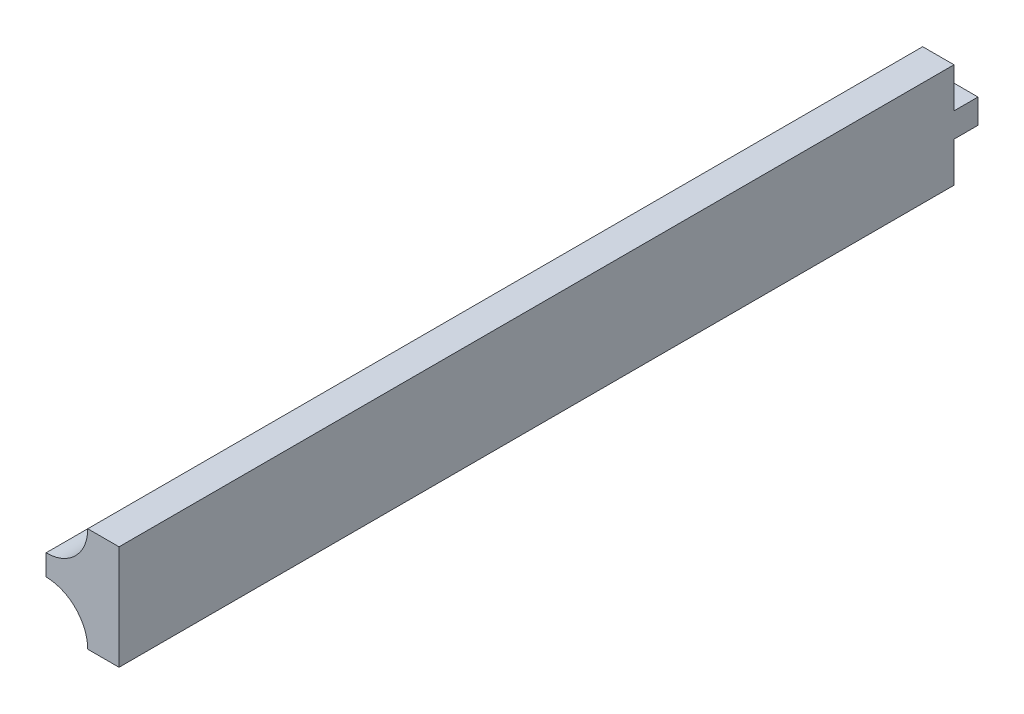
ISO-10303-21;
HEADER;
FILE_DESCRIPTION(('STEP AP214'),'2;1');
FILE_NAME('part.step','',(''),(''),'','','');
FILE_SCHEMA(('AUTOMOTIVE_DESIGN { 1 0 10303 214 1 1 1 1 }'));
ENDSEC;
DATA;
#1=APPLICATION_CONTEXT('core data for automotive mechanical design processes');
#2=APPLICATION_PROTOCOL_DEFINITION('international standard','automotive_design',2000,#1);
#3=PRODUCT_CONTEXT('',#1,'mechanical');
#4=PRODUCT('Part','Part','',(#3));
#5=PRODUCT_RELATED_PRODUCT_CATEGORY('part','',(#4));
#6=PRODUCT_DEFINITION_FORMATION('','',#4);
#7=PRODUCT_DEFINITION_CONTEXT('part definition',#1,'design');
#8=PRODUCT_DEFINITION('design','',#6,#7);
#9=PRODUCT_DEFINITION_SHAPE('','',#8);
#10=(LENGTH_UNIT() NAMED_UNIT(*) SI_UNIT(.MILLI.,.METRE.));
#11=(NAMED_UNIT(*) PLANE_ANGLE_UNIT() SI_UNIT($,.RADIAN.));
#12=(NAMED_UNIT(*) SI_UNIT($,.STERADIAN.) SOLID_ANGLE_UNIT());
#13=UNCERTAINTY_MEASURE_WITH_UNIT(LENGTH_MEASURE(1.E-05),#10,'distance_accuracy_value','');
#14=(GEOMETRIC_REPRESENTATION_CONTEXT(3) GLOBAL_UNCERTAINTY_ASSIGNED_CONTEXT((#13)) GLOBAL_UNIT_ASSIGNED_CONTEXT((#10,
#11,#12)) REPRESENTATION_CONTEXT('',''));
#15=CARTESIAN_POINT('',(0.,0.,0.));
#16=DIRECTION('',(0.,0.,1.));
#17=DIRECTION('',(1.,0.,0.));
#18=AXIS2_PLACEMENT_3D('',#15,#16,#17);
#19=CARTESIAN_POINT('',(0.,0.,0.));
#20=DIRECTION('',(0.,0.,-1.));
#21=DIRECTION('',(-1.,0.,0.));
#22=AXIS2_PLACEMENT_3D('',#19,#20,#21);
#23=PLANE('',#22);
#24=DIRECTION('',(0.,-1.,0.));
#25=VECTOR('',#24,1.);
#26=CARTESIAN_POINT('',(109.22,0.,0.));
#27=LINE('',#26,#25);
#28=CARTESIAN_POINT('',(109.22,2.54000000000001,0.));
#29=VERTEX_POINT('',#28);
#30=CARTESIAN_POINT('',(109.22,-2.53999999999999,0.));
#31=VERTEX_POINT('',#30);
#32=EDGE_CURVE('E177',#29,#31,#27,.T.);
#33=ORIENTED_EDGE('',*,*,#32,.F.);
#34=CARTESIAN_POINT('',(109.22,12.7,0.));
#35=DIRECTION('',(0.,0.,1.));
#36=DIRECTION('',(1.,0.,0.));
#37=AXIS2_PLACEMENT_3D('',#34,#35,#36);
#38=CIRCLE('',#37,10.16);
#39=CARTESIAN_POINT('',(119.38,12.7,0.));
#40=VERTEX_POINT('',#39);
#41=EDGE_CURVE('E203',#40,#29,#38,.F.);
#42=ORIENTED_EDGE('',*,*,#41,.F.);
#43=DIRECTION('',(-1.,0.,0.));
#44=VECTOR('',#43,1.);
#45=CARTESIAN_POINT('',(127.,12.7,0.));
#46=LINE('',#45,#44);
#47=CARTESIAN_POINT('',(127.,12.7,0.));
#48=VERTEX_POINT('',#47);
#49=EDGE_CURVE('E206',#48,#40,#46,.T.);
#50=ORIENTED_EDGE('',*,*,#49,.F.);
#51=DIRECTION('',(0.,1.,0.));
#52=VECTOR('',#51,1.);
#53=CARTESIAN_POINT('',(127.,2.54000000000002,0.));
#54=LINE('',#53,#52);
#55=CARTESIAN_POINT('',(127.,2.9845,0.));
#56=VERTEX_POINT('',#55);
#57=EDGE_CURVE('E209',#56,#48,#54,.T.);
#58=ORIENTED_EDGE('',*,*,#57,.F.);
#59=DIRECTION('',(1.,0.,0.));
#60=VECTOR('',#59,1.);
#61=CARTESIAN_POINT('',(127.,2.9845,0.));
#62=LINE('',#61,#60);
#63=CARTESIAN_POINT('',(121.031,2.9845,0.));
#64=VERTEX_POINT('',#63);
#65=EDGE_CURVE('E193',#64,#56,#62,.T.);
#66=ORIENTED_EDGE('',*,*,#65,.F.);
#67=DIRECTION('',(0.,1.,0.));
#68=VECTOR('',#67,1.);
#69=CARTESIAN_POINT('',(121.031,2.9845,0.));
#70=LINE('',#69,#68);
#71=CARTESIAN_POINT('',(121.031,-2.9845,0.));
#72=VERTEX_POINT('',#71);
#73=EDGE_CURVE('E179',#72,#64,#70,.T.);
#74=ORIENTED_EDGE('',*,*,#73,.F.);
#75=DIRECTION('',(-1.,0.,0.));
#76=VECTOR('',#75,1.);
#77=CARTESIAN_POINT('',(127.,-2.9845,0.));
#78=LINE('',#77,#76);
#79=CARTESIAN_POINT('',(127.,-2.9845,0.));
#80=VERTEX_POINT('',#79);
#81=EDGE_CURVE('E184',#80,#72,#78,.T.);
#82=ORIENTED_EDGE('',*,*,#81,.F.);
#83=CARTESIAN_POINT('',(127.,-12.7,0.));
#84=VERTEX_POINT('',#83);
#85=EDGE_CURVE('E210',#84,#80,#54,.T.);
#86=ORIENTED_EDGE('',*,*,#85,.F.);
#87=DIRECTION('',(-1.,0.,0.));
#88=VECTOR('',#87,1.);
#89=CARTESIAN_POINT('',(127.,-12.7,0.));
#90=LINE('',#89,#88);
#91=CARTESIAN_POINT('',(119.38,-12.7,0.));
#92=VERTEX_POINT('',#91);
#93=EDGE_CURVE('E213',#84,#92,#90,.T.);
#94=ORIENTED_EDGE('',*,*,#93,.T.);
#95=CARTESIAN_POINT('',(109.22,-12.7,0.));
#96=DIRECTION('',(0.,0.,1.));
#97=DIRECTION('',(1.,0.,0.));
#98=AXIS2_PLACEMENT_3D('',#95,#96,#97);
#99=CIRCLE('',#98,10.16);
#100=EDGE_CURVE('E215',#31,#92,#99,.F.);
#101=ORIENTED_EDGE('',*,*,#100,.F.);
#102=EDGE_LOOP('',(#33,#42,#50,#58,#66,#74,#82,#86,#94,#101));
#103=FACE_BOUND('',#102,.T.);
#104=ADVANCED_FACE('F35',(#103),#23,.T.);
#105=CARTESIAN_POINT('',(127.,2.54000000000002,203.2));
#106=DIRECTION('',(-1.,0.,0.));
#107=DIRECTION('',(0.,0.,1.));
#108=AXIS2_PLACEMENT_3D('',#105,#106,#107);
#109=PLANE('',#108);
#110=DIRECTION('',(0.,0.,-1.));
#111=VECTOR('',#110,1.);
#112=CARTESIAN_POINT('',(127.,-12.7,215.9));
#113=LINE('',#112,#111);
#114=CARTESIAN_POINT('',(127.,-12.7,203.2));
#115=VERTEX_POINT('',#114);
#116=EDGE_CURVE('E218',#115,#84,#113,.T.);
#117=ORIENTED_EDGE('',*,*,#116,.T.);
#118=ORIENTED_EDGE('',*,*,#85,.T.);
#119=DIRECTION('',(0.,0.,1.));
#120=VECTOR('',#119,1.);
#121=CARTESIAN_POINT('',(127.,-2.9845,-5.842));
#122=LINE('',#121,#120);
#123=CARTESIAN_POINT('',(127.,-2.9845,-5.842));
#124=VERTEX_POINT('',#123);
#125=EDGE_CURVE('E198',#124,#80,#122,.T.);
#126=ORIENTED_EDGE('',*,*,#125,.F.);
#127=DIRECTION('',(0.,-1.,0.));
#128=VECTOR('',#127,1.);
#129=CARTESIAN_POINT('',(127.,2.9845,-5.842));
#130=LINE('',#129,#128);
#131=CARTESIAN_POINT('',(127.,2.9845,-5.842));
#132=VERTEX_POINT('',#131);
#133=EDGE_CURVE('E186',#132,#124,#130,.T.);
#134=ORIENTED_EDGE('',*,*,#133,.F.);
#135=DIRECTION('',(0.,0.,1.));
#136=VECTOR('',#135,1.);
#137=CARTESIAN_POINT('',(127.,2.9845,-5.842));
#138=LINE('',#137,#136);
#139=EDGE_CURVE('E58',#132,#56,#138,.T.);
#140=ORIENTED_EDGE('',*,*,#139,.T.);
#141=ORIENTED_EDGE('',*,*,#57,.T.);
#142=DIRECTION('',(0.,0.,-1.));
#143=VECTOR('',#142,1.);
#144=CARTESIAN_POINT('',(127.,12.7,215.9));
#145=LINE('',#144,#143);
#146=CARTESIAN_POINT('',(127.,12.7,203.2));
#147=VERTEX_POINT('',#146);
#148=EDGE_CURVE('E232',#147,#48,#145,.T.);
#149=ORIENTED_EDGE('',*,*,#148,.F.);
#150=DIRECTION('',(0.,1.,0.));
#151=VECTOR('',#150,1.);
#152=CARTESIAN_POINT('',(127.,2.54000000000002,203.2));
#153=LINE('',#152,#151);
#154=EDGE_CURVE('E231',#115,#147,#153,.T.);
#155=ORIENTED_EDGE('',*,*,#154,.F.);
#156=EDGE_LOOP('',(#117,#118,#126,#134,#140,#141,#149,#155));
#157=FACE_BOUND('',#156,.T.);
#158=ADVANCED_FACE('F264',(#157),#109,.F.);
#159=CARTESIAN_POINT('',(0.,0.,203.2));
#160=DIRECTION('',(0.,0.,-1.));
#161=DIRECTION('',(-1.,0.,0.));
#162=AXIS2_PLACEMENT_3D('',#159,#160,#161);
#163=PLANE('',#162);
#164=CARTESIAN_POINT('',(109.22,12.7,203.2));
#165=DIRECTION('',(0.,0.,-1.));
#166=DIRECTION('',(-1.,0.,0.));
#167=AXIS2_PLACEMENT_3D('',#164,#165,#166);
#168=CIRCLE('',#167,10.16);
#169=CARTESIAN_POINT('',(119.38,12.7,203.2));
#170=VERTEX_POINT('',#169);
#171=CARTESIAN_POINT('',(109.22,2.54000000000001,203.2));
#172=VERTEX_POINT('',#171);
#173=EDGE_CURVE('E43',#170,#172,#168,.T.);
#174=ORIENTED_EDGE('',*,*,#173,.T.);
#175=DIRECTION('',(0.,-1.,0.));
#176=VECTOR('',#175,1.);
#177=CARTESIAN_POINT('',(109.22,0.,203.2));
#178=LINE('',#177,#176);
#179=CARTESIAN_POINT('',(109.22,-2.53999999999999,203.2));
#180=VERTEX_POINT('',#179);
#181=EDGE_CURVE('E171',#172,#180,#178,.T.);
#182=ORIENTED_EDGE('',*,*,#181,.T.);
#183=CARTESIAN_POINT('',(109.22,-12.7,203.2));
#184=DIRECTION('',(0.,0.,-1.));
#185=DIRECTION('',(-1.,0.,0.));
#186=AXIS2_PLACEMENT_3D('',#183,#184,#185);
#187=CIRCLE('',#186,10.16);
#188=CARTESIAN_POINT('',(119.38,-12.7,203.2));
#189=VERTEX_POINT('',#188);
#190=EDGE_CURVE('E11',#180,#189,#187,.T.);
#191=ORIENTED_EDGE('',*,*,#190,.T.);
#192=DIRECTION('',(1.,0.,0.));
#193=VECTOR('',#192,1.);
#194=CARTESIAN_POINT('',(127.,-12.7,203.2));
#195=LINE('',#194,#193);
#196=EDGE_CURVE('E224',#189,#115,#195,.T.);
#197=ORIENTED_EDGE('',*,*,#196,.T.);
#198=ORIENTED_EDGE('',*,*,#154,.T.);
#199=DIRECTION('',(1.,0.,0.));
#200=VECTOR('',#199,1.);
#201=CARTESIAN_POINT('',(127.,12.7,203.2));
#202=LINE('',#201,#200);
#203=EDGE_CURVE('E228',#170,#147,#202,.T.);
#204=ORIENTED_EDGE('',*,*,#203,.F.);
#205=EDGE_LOOP('',(#174,#182,#191,#197,#198,#204));
#206=FACE_BOUND('',#205,.T.);
#207=ADVANCED_FACE('F245',(#206),#163,.F.);
#208=CARTESIAN_POINT('',(127.,12.7,215.9));
#209=DIRECTION('',(0.,-1.,0.));
#210=DIRECTION('',(0.,0.,-1.));
#211=AXIS2_PLACEMENT_3D('',#208,#209,#210);
#212=PLANE('',#211);
#213=ORIENTED_EDGE('',*,*,#148,.T.);
#214=ORIENTED_EDGE('',*,*,#49,.T.);
#215=DIRECTION('',(0.,0.,-1.));
#216=VECTOR('',#215,1.);
#217=CARTESIAN_POINT('',(119.38,12.7,215.9));
#218=LINE('',#217,#216);
#219=EDGE_CURVE('E227',#170,#40,#218,.T.);
#220=ORIENTED_EDGE('',*,*,#219,.F.);
#221=ORIENTED_EDGE('',*,*,#203,.T.);
#222=EDGE_LOOP('',(#213,#214,#220,#221));
#223=FACE_BOUND('',#222,.T.);
#224=ADVANCED_FACE('F269',(#223),#212,.F.);
#225=CARTESIAN_POINT('',(127.,-12.7,215.9));
#226=DIRECTION('',(0.,-1.,0.));
#227=DIRECTION('',(1.,0.,0.));
#228=AXIS2_PLACEMENT_3D('',#225,#226,#227);
#229=PLANE('',#228);
#230=ORIENTED_EDGE('',*,*,#93,.F.);
#231=ORIENTED_EDGE('',*,*,#116,.F.);
#232=ORIENTED_EDGE('',*,*,#196,.F.);
#233=DIRECTION('',(0.,0.,-1.));
#234=VECTOR('',#233,1.);
#235=CARTESIAN_POINT('',(119.38,-12.7,215.9));
#236=LINE('',#235,#234);
#237=EDGE_CURVE('E221',#189,#92,#236,.T.);
#238=ORIENTED_EDGE('',*,*,#237,.T.);
#239=EDGE_LOOP('',(#230,#231,#232,#238));
#240=FACE_BOUND('',#239,.T.);
#241=ADVANCED_FACE('F263',(#240),#229,.T.);
#242=CARTESIAN_POINT('',(109.22,12.7,203.2));
#243=DIRECTION('',(0.,0.,1.));
#244=DIRECTION('',(1.,0.,0.));
#245=AXIS2_PLACEMENT_3D('',#242,#243,#244);
#246=CYLINDRICAL_SURFACE('',#245,10.16);
#247=ORIENTED_EDGE('',*,*,#219,.T.);
#248=ORIENTED_EDGE('',*,*,#41,.T.);
#249=DIRECTION('',(0.,0.,-1.));
#250=VECTOR('',#249,1.);
#251=CARTESIAN_POINT('',(109.22,2.54000000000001,-12.7));
#252=LINE('',#251,#250);
#253=EDGE_CURVE('E238',#172,#29,#252,.T.);
#254=ORIENTED_EDGE('',*,*,#253,.F.);
#255=ORIENTED_EDGE('',*,*,#173,.F.);
#256=EDGE_LOOP('',(#247,#248,#254,#255));
#257=FACE_BOUND('',#256,.T.);
#258=ADVANCED_FACE('F249',(#257),#246,.F.);
#259=CARTESIAN_POINT('',(109.22,-12.7,215.9));
#260=DIRECTION('',(0.,0.,-1.));
#261=DIRECTION('',(-1.,0.,0.));
#262=AXIS2_PLACEMENT_3D('',#259,#260,#261);
#263=CYLINDRICAL_SURFACE('',#262,10.16);
#264=DIRECTION('',(0.,0.,-1.));
#265=VECTOR('',#264,1.);
#266=CARTESIAN_POINT('',(109.22,-2.53999999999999,203.2));
#267=LINE('',#266,#265);
#268=EDGE_CURVE('E240',#31,#180,#267,.F.);
#269=ORIENTED_EDGE('',*,*,#268,.F.);
#270=ORIENTED_EDGE('',*,*,#100,.T.);
#271=ORIENTED_EDGE('',*,*,#237,.F.);
#272=ORIENTED_EDGE('',*,*,#190,.F.);
#273=EDGE_LOOP('',(#269,#270,#271,#272));
#274=FACE_BOUND('',#273,.T.);
#275=ADVANCED_FACE('F37',(#274),#263,.F.);
#276=CARTESIAN_POINT('',(121.031,2.9845,-5.842));
#277=DIRECTION('',(1.,0.,0.));
#278=DIRECTION('',(0.,0.,-1.));
#279=AXIS2_PLACEMENT_3D('',#276,#277,#278);
#280=PLANE('',#279);
#281=ORIENTED_EDGE('',*,*,#73,.T.);
#282=DIRECTION('',(0.,0.,1.));
#283=VECTOR('',#282,1.);
#284=CARTESIAN_POINT('',(121.031,2.9845,-5.842));
#285=LINE('',#284,#283);
#286=CARTESIAN_POINT('',(121.031,2.9845,-5.842));
#287=VERTEX_POINT('',#286);
#288=EDGE_CURVE('E201',#287,#64,#285,.T.);
#289=ORIENTED_EDGE('',*,*,#288,.F.);
#290=DIRECTION('',(0.,1.,0.));
#291=VECTOR('',#290,1.);
#292=CARTESIAN_POINT('',(121.031,2.9845,-5.842));
#293=LINE('',#292,#291);
#294=CARTESIAN_POINT('',(121.031,-2.9845,-5.842));
#295=VERTEX_POINT('',#294);
#296=EDGE_CURVE('E180',#295,#287,#293,.T.);
#297=ORIENTED_EDGE('',*,*,#296,.F.);
#298=DIRECTION('',(0.,0.,1.));
#299=VECTOR('',#298,1.);
#300=CARTESIAN_POINT('',(121.031,-2.9845,-5.842));
#301=LINE('',#300,#299);
#302=EDGE_CURVE('E190',#295,#72,#301,.T.);
#303=ORIENTED_EDGE('',*,*,#302,.T.);
#304=EDGE_LOOP('',(#281,#289,#297,#303));
#305=FACE_BOUND('',#304,.T.);
#306=ADVANCED_FACE('F278',(#305),#280,.F.);
#307=CARTESIAN_POINT('',(127.,2.9845,-5.842));
#308=DIRECTION('',(0.,-1.,0.));
#309=DIRECTION('',(0.,0.,-1.));
#310=AXIS2_PLACEMENT_3D('',#307,#308,#309);
#311=PLANE('',#310);
#312=ORIENTED_EDGE('',*,*,#65,.T.);
#313=ORIENTED_EDGE('',*,*,#139,.F.);
#314=DIRECTION('',(1.,0.,0.));
#315=VECTOR('',#314,1.);
#316=CARTESIAN_POINT('',(127.,2.9845,-5.842));
#317=LINE('',#316,#315);
#318=EDGE_CURVE('E183',#287,#132,#317,.T.);
#319=ORIENTED_EDGE('',*,*,#318,.F.);
#320=ORIENTED_EDGE('',*,*,#288,.T.);
#321=EDGE_LOOP('',(#312,#313,#319,#320));
#322=FACE_BOUND('',#321,.T.);
#323=ADVANCED_FACE('F274',(#322),#311,.F.);
#324=CARTESIAN_POINT('',(127.,-2.9845,-5.842));
#325=DIRECTION('',(0.,1.,0.));
#326=DIRECTION('',(0.,0.,1.));
#327=AXIS2_PLACEMENT_3D('',#324,#325,#326);
#328=PLANE('',#327);
#329=ORIENTED_EDGE('',*,*,#81,.T.);
#330=ORIENTED_EDGE('',*,*,#302,.F.);
#331=DIRECTION('',(-1.,0.,0.));
#332=VECTOR('',#331,1.);
#333=CARTESIAN_POINT('',(127.,-2.9845,-5.842));
#334=LINE('',#333,#332);
#335=EDGE_CURVE('E188',#124,#295,#334,.T.);
#336=ORIENTED_EDGE('',*,*,#335,.F.);
#337=ORIENTED_EDGE('',*,*,#125,.T.);
#338=EDGE_LOOP('',(#329,#330,#336,#337));
#339=FACE_BOUND('',#338,.T.);
#340=ADVANCED_FACE('F282',(#339),#328,.F.);
#341=CARTESIAN_POINT('',(0.,0.,-5.842));
#342=DIRECTION('',(0.,0.,-1.));
#343=DIRECTION('',(-1.,0.,0.));
#344=AXIS2_PLACEMENT_3D('',#341,#342,#343);
#345=PLANE('',#344);
#346=ORIENTED_EDGE('',*,*,#296,.T.);
#347=ORIENTED_EDGE('',*,*,#318,.T.);
#348=ORIENTED_EDGE('',*,*,#133,.T.);
#349=ORIENTED_EDGE('',*,*,#335,.T.);
#350=EDGE_LOOP('',(#346,#347,#348,#349));
#351=FACE_BOUND('',#350,.T.);
#352=ADVANCED_FACE('F284',(#351),#345,.T.);
#353=CARTESIAN_POINT('',(109.22,-12.7,-55.8325034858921));
#354=DIRECTION('',(1.,0.,0.));
#355=DIRECTION('',(0.,1.,0.));
#356=AXIS2_PLACEMENT_3D('',#353,#354,#355);
#357=PLANE('',#356);
#358=DIRECTION('',(0.,0.,-1.));
#359=VECTOR('',#358,1.);
#360=CARTESIAN_POINT('',(109.22,1.39700000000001,5.842));
#361=LINE('',#360,#359);
#362=CARTESIAN_POINT('',(109.22,1.39700000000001,197.358));
#363=VERTEX_POINT('',#362);
#364=CARTESIAN_POINT('',(109.22,1.39700000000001,5.842));
#365=VERTEX_POINT('',#364);
#366=EDGE_CURVE('E165',#363,#365,#361,.T.);
#367=ORIENTED_EDGE('',*,*,#366,.F.);
#368=DIRECTION('',(0.,1.,0.));
#369=VECTOR('',#368,1.);
#370=CARTESIAN_POINT('',(109.22,-1.39699999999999,197.358));
#371=LINE('',#370,#369);
#372=CARTESIAN_POINT('',(109.22,-1.39699999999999,197.358));
#373=VERTEX_POINT('',#372);
#374=EDGE_CURVE('E50',#373,#363,#371,.T.);
#375=ORIENTED_EDGE('',*,*,#374,.F.);
#376=DIRECTION('',(0.,0.,1.));
#377=VECTOR('',#376,1.);
#378=CARTESIAN_POINT('',(109.22,-1.39699999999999,5.842));
#379=LINE('',#378,#377);
#380=CARTESIAN_POINT('',(109.22,-1.39699999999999,5.842));
#381=VERTEX_POINT('',#380);
#382=EDGE_CURVE('E156',#381,#373,#379,.T.);
#383=ORIENTED_EDGE('',*,*,#382,.F.);
#384=DIRECTION('',(0.,-1.,0.));
#385=VECTOR('',#384,1.);
#386=CARTESIAN_POINT('',(109.22,-1.39699999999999,5.842));
#387=LINE('',#386,#385);
#388=EDGE_CURVE('E159',#365,#381,#387,.T.);
#389=ORIENTED_EDGE('',*,*,#388,.F.);
#390=EDGE_LOOP('',(#367,#375,#383,#389));
#391=FACE_BOUND('',#390,.T.);
#392=ORIENTED_EDGE('',*,*,#32,.T.);
#393=ORIENTED_EDGE('',*,*,#268,.T.);
#394=ORIENTED_EDGE('',*,*,#181,.F.);
#395=ORIENTED_EDGE('',*,*,#253,.T.);
#396=EDGE_LOOP('',(#392,#393,#394,#395));
#397=FACE_BOUND('',#396,.T.);
#398=ADVANCED_FACE('F252',(#391,#397),#357,.F.);
#399=CARTESIAN_POINT('',(114.808,-1.39699999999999,197.358));
#400=DIRECTION('',(0.,0.,1.));
#401=DIRECTION('',(1.,0.,0.));
#402=AXIS2_PLACEMENT_3D('',#399,#400,#401);
#403=PLANE('',#402);
#404=ORIENTED_EDGE('',*,*,#374,.T.);
#405=DIRECTION('',(-1.,0.,0.));
#406=VECTOR('',#405,1.);
#407=CARTESIAN_POINT('',(114.808,1.39700000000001,197.358));
#408=LINE('',#407,#406);
#409=CARTESIAN_POINT('',(114.808,1.39700000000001,197.358));
#410=VERTEX_POINT('',#409);
#411=EDGE_CURVE('E134',#410,#363,#408,.T.);
#412=ORIENTED_EDGE('',*,*,#411,.F.);
#413=DIRECTION('',(0.,1.,0.));
#414=VECTOR('',#413,1.);
#415=CARTESIAN_POINT('',(114.808,-1.39699999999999,197.358));
#416=LINE('',#415,#414);
#417=CARTESIAN_POINT('',(114.808,-1.39699999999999,197.358));
#418=VERTEX_POINT('',#417);
#419=EDGE_CURVE('E138',#418,#410,#416,.T.);
#420=ORIENTED_EDGE('',*,*,#419,.F.);
#421=DIRECTION('',(-1.,0.,0.));
#422=VECTOR('',#421,1.);
#423=CARTESIAN_POINT('',(114.808,-1.39699999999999,197.358));
#424=LINE('',#423,#422);
#425=EDGE_CURVE('E169',#418,#373,#424,.T.);
#426=ORIENTED_EDGE('',*,*,#425,.T.);
#427=EDGE_LOOP('',(#404,#412,#420,#426));
#428=FACE_BOUND('',#427,.T.);
#429=ADVANCED_FACE('F136',(#428),#403,.F.);
#430=CARTESIAN_POINT('',(114.808,-1.39699999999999,5.842));
#431=DIRECTION('',(0.,-1.,0.));
#432=DIRECTION('',(1.,0.,0.));
#433=AXIS2_PLACEMENT_3D('',#430,#431,#432);
#434=PLANE('',#433);
#435=ORIENTED_EDGE('',*,*,#382,.T.);
#436=ORIENTED_EDGE('',*,*,#425,.F.);
#437=DIRECTION('',(0.,0.,1.));
#438=VECTOR('',#437,1.);
#439=CARTESIAN_POINT('',(114.808,-1.39699999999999,5.842));
#440=LINE('',#439,#438);
#441=CARTESIAN_POINT('',(114.808,-1.39699999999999,5.842));
#442=VERTEX_POINT('',#441);
#443=EDGE_CURVE('E144',#442,#418,#440,.T.);
#444=ORIENTED_EDGE('',*,*,#443,.F.);
#445=DIRECTION('',(-1.,0.,0.));
#446=VECTOR('',#445,1.);
#447=CARTESIAN_POINT('',(114.808,-1.39699999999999,5.842));
#448=LINE('',#447,#446);
#449=EDGE_CURVE('E172',#442,#381,#448,.T.);
#450=ORIENTED_EDGE('',*,*,#449,.T.);
#451=EDGE_LOOP('',(#435,#436,#444,#450));
#452=FACE_BOUND('',#451,.T.);
#453=ADVANCED_FACE('F368',(#452),#434,.F.);
#454=CARTESIAN_POINT('',(114.808,-1.39699999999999,5.842));
#455=DIRECTION('',(0.,0.,-1.));
#456=DIRECTION('',(-1.,0.,0.));
#457=AXIS2_PLACEMENT_3D('',#454,#455,#456);
#458=PLANE('',#457);
#459=ORIENTED_EDGE('',*,*,#388,.T.);
#460=ORIENTED_EDGE('',*,*,#449,.F.);
#461=DIRECTION('',(0.,-1.,0.));
#462=VECTOR('',#461,1.);
#463=CARTESIAN_POINT('',(114.808,-1.39699999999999,5.842));
#464=LINE('',#463,#462);
#465=CARTESIAN_POINT('',(114.808,1.39700000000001,5.842));
#466=VERTEX_POINT('',#465);
#467=EDGE_CURVE('E152',#466,#442,#464,.T.);
#468=ORIENTED_EDGE('',*,*,#467,.F.);
#469=DIRECTION('',(-1.,0.,0.));
#470=VECTOR('',#469,1.);
#471=CARTESIAN_POINT('',(114.808,1.39700000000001,5.842));
#472=LINE('',#471,#470);
#473=EDGE_CURVE('E143',#466,#365,#472,.T.);
#474=ORIENTED_EDGE('',*,*,#473,.T.);
#475=EDGE_LOOP('',(#459,#460,#468,#474));
#476=FACE_BOUND('',#475,.T.);
#477=ADVANCED_FACE('F377',(#476),#458,.F.);
#478=CARTESIAN_POINT('',(114.808,1.39700000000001,5.842));
#479=DIRECTION('',(0.,1.,0.));
#480=DIRECTION('',(-1.,0.,0.));
#481=AXIS2_PLACEMENT_3D('',#478,#479,#480);
#482=PLANE('',#481);
#483=ORIENTED_EDGE('',*,*,#366,.T.);
#484=ORIENTED_EDGE('',*,*,#473,.F.);
#485=DIRECTION('',(0.,0.,-1.));
#486=VECTOR('',#485,1.);
#487=CARTESIAN_POINT('',(114.808,1.39700000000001,5.842));
#488=LINE('',#487,#486);
#489=EDGE_CURVE('E147',#410,#466,#488,.T.);
#490=ORIENTED_EDGE('',*,*,#489,.F.);
#491=ORIENTED_EDGE('',*,*,#411,.T.);
#492=EDGE_LOOP('',(#483,#484,#490,#491));
#493=FACE_BOUND('',#492,.T.);
#494=ADVANCED_FACE('F148',(#493),#482,.F.);
#495=CARTESIAN_POINT('',(114.808,0.,0.));
#496=DIRECTION('',(1.,0.,0.));
#497=DIRECTION('',(0.,0.,-1.));
#498=AXIS2_PLACEMENT_3D('',#495,#496,#497);
#499=PLANE('',#498);
#500=ORIENTED_EDGE('',*,*,#419,.T.);
#501=ORIENTED_EDGE('',*,*,#489,.T.);
#502=ORIENTED_EDGE('',*,*,#467,.T.);
#503=ORIENTED_EDGE('',*,*,#443,.T.);
#504=EDGE_LOOP('',(#500,#501,#502,#503));
#505=FACE_BOUND('',#504,.T.);
#506=ADVANCED_FACE('F154',(#505),#499,.F.);
#507=CLOSED_SHELL('',(#104,#158,#207,#224,#241,#258,#275,#306,#323,#340,#352,#398,#429,#453,
#477,#494,#506));
#508=MANIFOLD_SOLID_BREP('B2',#507);
#509=ADVANCED_BREP_SHAPE_REPRESENTATION('',(#18,#508),#14);
#510=SHAPE_DEFINITION_REPRESENTATION(#9,#509);
ENDSEC;
END-ISO-10303-21;
